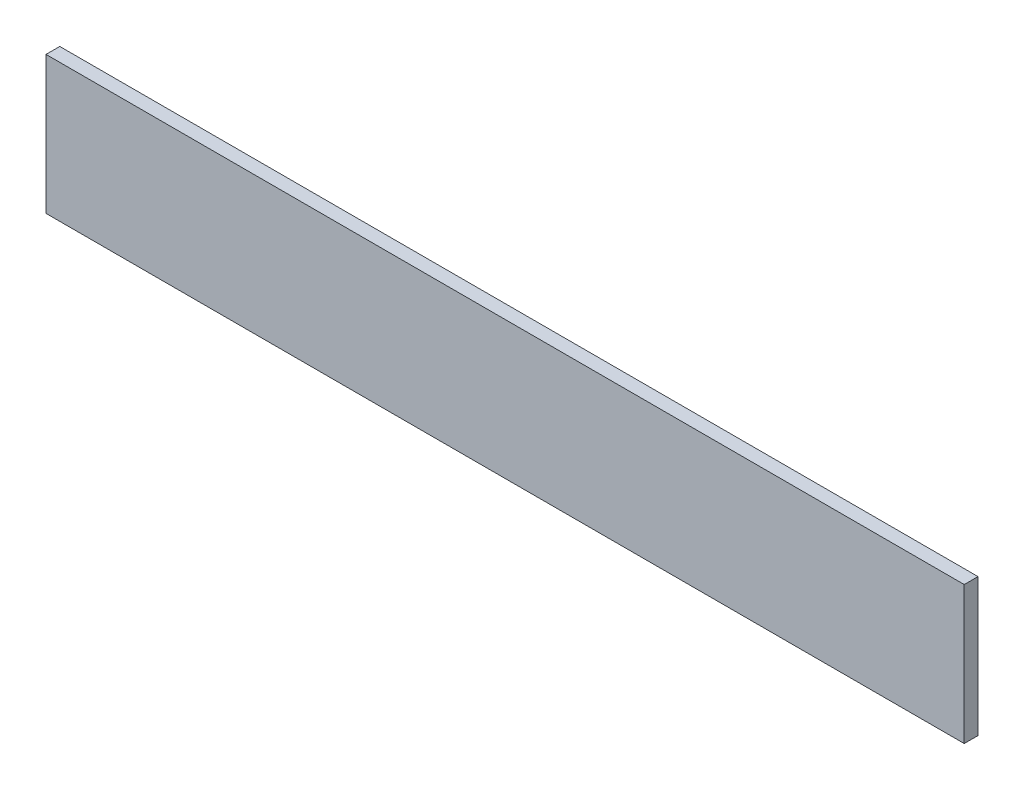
ISO-10303-21;
HEADER;
FILE_DESCRIPTION(('STEP AP214'),'2;1');
FILE_NAME('part.step','',(''),(''),'','','');
FILE_SCHEMA(('AUTOMOTIVE_DESIGN { 1 0 10303 214 1 1 1 1 }'));
ENDSEC;
DATA;
#1=APPLICATION_CONTEXT('core data for automotive mechanical design processes');
#2=APPLICATION_PROTOCOL_DEFINITION('international standard','automotive_design',2000,#1);
#3=PRODUCT_CONTEXT('',#1,'mechanical');
#4=PRODUCT('Part','Part','',(#3));
#5=PRODUCT_RELATED_PRODUCT_CATEGORY('part','',(#4));
#6=PRODUCT_DEFINITION_FORMATION('','',#4);
#7=PRODUCT_DEFINITION_CONTEXT('part definition',#1,'design');
#8=PRODUCT_DEFINITION('design','',#6,#7);
#9=PRODUCT_DEFINITION_SHAPE('','',#8);
#10=(LENGTH_UNIT() NAMED_UNIT(*) SI_UNIT(.MILLI.,.METRE.));
#11=(NAMED_UNIT(*) PLANE_ANGLE_UNIT() SI_UNIT($,.RADIAN.));
#12=(NAMED_UNIT(*) SI_UNIT($,.STERADIAN.) SOLID_ANGLE_UNIT());
#13=UNCERTAINTY_MEASURE_WITH_UNIT(LENGTH_MEASURE(1.E-05),#10,'distance_accuracy_value','');
#14=(GEOMETRIC_REPRESENTATION_CONTEXT(3) GLOBAL_UNCERTAINTY_ASSIGNED_CONTEXT((#13)) GLOBAL_UNIT_ASSIGNED_CONTEXT((#10,
#11,#12)) REPRESENTATION_CONTEXT('',''));
#15=CARTESIAN_POINT('',(0.,0.,0.));
#16=DIRECTION('',(0.,0.,1.));
#17=DIRECTION('',(1.,0.,0.));
#18=AXIS2_PLACEMENT_3D('',#15,#16,#17);
#19=CARTESIAN_POINT('',(0.,0.,0.6));
#20=DIRECTION('',(1.,0.,0.));
#21=DIRECTION('',(0.,0.,-1.));
#22=AXIS2_PLACEMENT_3D('',#19,#20,#21);
#23=PLANE('',#22);
#24=DIRECTION('',(0.,-1.,0.));
#25=VECTOR('',#24,1.);
#26=CARTESIAN_POINT('',(0.,0.,-0.6));
#27=LINE('',#26,#25);
#28=CARTESIAN_POINT('',(0.,12.,-0.6));
#29=VERTEX_POINT('',#28);
#30=CARTESIAN_POINT('',(0.,0.,-0.6));
#31=VERTEX_POINT('',#30);
#32=EDGE_CURVE('E81',#29,#31,#27,.T.);
#33=ORIENTED_EDGE('',*,*,#32,.T.);
#34=DIRECTION('',(0.,0.,-1.));
#35=VECTOR('',#34,1.);
#36=CARTESIAN_POINT('',(0.,0.,0.6));
#37=LINE('',#36,#35);
#38=CARTESIAN_POINT('',(0.,0.,0.6));
#39=VERTEX_POINT('',#38);
#40=EDGE_CURVE('E11',#39,#31,#37,.T.);
#41=ORIENTED_EDGE('',*,*,#40,.F.);
#42=DIRECTION('',(0.,-1.,0.));
#43=VECTOR('',#42,1.);
#44=CARTESIAN_POINT('',(0.,0.,0.6));
#45=LINE('',#44,#43);
#46=CARTESIAN_POINT('',(0.,12.,0.6));
#47=VERTEX_POINT('',#46);
#48=EDGE_CURVE('E99',#47,#39,#45,.T.);
#49=ORIENTED_EDGE('',*,*,#48,.F.);
#50=DIRECTION('',(0.,0.,-1.));
#51=VECTOR('',#50,1.);
#52=CARTESIAN_POINT('',(0.,12.,0.6));
#53=LINE('',#52,#51);
#54=EDGE_CURVE('E93',#47,#29,#53,.T.);
#55=ORIENTED_EDGE('',*,*,#54,.T.);
#56=EDGE_LOOP('',(#33,#41,#49,#55));
#57=FACE_BOUND('',#56,.T.);
#58=ADVANCED_FACE('F37',(#57),#23,.F.);
#59=CARTESIAN_POINT('',(0.,0.,0.6));
#60=DIRECTION('',(0.,1.,0.));
#61=DIRECTION('',(0.,0.,1.));
#62=AXIS2_PLACEMENT_3D('',#59,#60,#61);
#63=PLANE('',#62);
#64=DIRECTION('',(1.,0.,0.));
#65=VECTOR('',#64,1.);
#66=CARTESIAN_POINT('',(0.,0.,-0.6));
#67=LINE('',#66,#65);
#68=CARTESIAN_POINT('',(80.,0.,-0.6));
#69=VERTEX_POINT('',#68);
#70=EDGE_CURVE('E77',#31,#69,#67,.T.);
#71=ORIENTED_EDGE('',*,*,#70,.T.);
#72=DIRECTION('',(0.,0.,-1.));
#73=VECTOR('',#72,1.);
#74=CARTESIAN_POINT('',(80.,0.,0.6));
#75=LINE('',#74,#73);
#76=CARTESIAN_POINT('',(80.,0.,0.6));
#77=VERTEX_POINT('',#76);
#78=EDGE_CURVE('E44',#77,#69,#75,.T.);
#79=ORIENTED_EDGE('',*,*,#78,.F.);
#80=DIRECTION('',(1.,0.,0.));
#81=VECTOR('',#80,1.);
#82=CARTESIAN_POINT('',(0.,0.,0.6));
#83=LINE('',#82,#81);
#84=EDGE_CURVE('E89',#39,#77,#83,.T.);
#85=ORIENTED_EDGE('',*,*,#84,.F.);
#86=ORIENTED_EDGE('',*,*,#40,.T.);
#87=EDGE_LOOP('',(#71,#79,#85,#86));
#88=FACE_BOUND('',#87,.T.);
#89=ADVANCED_FACE('F88',(#88),#63,.F.);
#90=CARTESIAN_POINT('',(80.,0.,0.6));
#91=DIRECTION('',(-1.,0.,0.));
#92=DIRECTION('',(0.,0.,1.));
#93=AXIS2_PLACEMENT_3D('',#90,#91,#92);
#94=PLANE('',#93);
#95=DIRECTION('',(0.,1.,0.));
#96=VECTOR('',#95,1.);
#97=CARTESIAN_POINT('',(80.,0.,-0.6));
#98=LINE('',#97,#96);
#99=CARTESIAN_POINT('',(80.,12.,-0.6));
#100=VERTEX_POINT('',#99);
#101=EDGE_CURVE('E82',#69,#100,#98,.T.);
#102=ORIENTED_EDGE('',*,*,#101,.T.);
#103=DIRECTION('',(0.,0.,-1.));
#104=VECTOR('',#103,1.);
#105=CARTESIAN_POINT('',(80.,12.,0.6));
#106=LINE('',#105,#104);
#107=CARTESIAN_POINT('',(80.,12.,0.6));
#108=VERTEX_POINT('',#107);
#109=EDGE_CURVE('E105',#108,#100,#106,.T.);
#110=ORIENTED_EDGE('',*,*,#109,.F.);
#111=DIRECTION('',(0.,1.,0.));
#112=VECTOR('',#111,1.);
#113=CARTESIAN_POINT('',(80.,0.,0.6));
#114=LINE('',#113,#112);
#115=EDGE_CURVE('E56',#77,#108,#114,.T.);
#116=ORIENTED_EDGE('',*,*,#115,.F.);
#117=ORIENTED_EDGE('',*,*,#78,.T.);
#118=EDGE_LOOP('',(#102,#110,#116,#117));
#119=FACE_BOUND('',#118,.T.);
#120=ADVANCED_FACE('F108',(#119),#94,.F.);
#121=CARTESIAN_POINT('',(0.,12.,0.6));
#122=DIRECTION('',(0.,-1.,0.));
#123=DIRECTION('',(0.,0.,-1.));
#124=AXIS2_PLACEMENT_3D('',#121,#122,#123);
#125=PLANE('',#124);
#126=DIRECTION('',(-1.,0.,0.));
#127=VECTOR('',#126,1.);
#128=CARTESIAN_POINT('',(0.,12.,-0.6));
#129=LINE('',#128,#127);
#130=EDGE_CURVE('E97',#100,#29,#129,.T.);
#131=ORIENTED_EDGE('',*,*,#130,.T.);
#132=ORIENTED_EDGE('',*,*,#54,.F.);
#133=DIRECTION('',(-1.,0.,0.));
#134=VECTOR('',#133,1.);
#135=CARTESIAN_POINT('',(0.,12.,0.6));
#136=LINE('',#135,#134);
#137=EDGE_CURVE('E51',#108,#47,#136,.T.);
#138=ORIENTED_EDGE('',*,*,#137,.F.);
#139=ORIENTED_EDGE('',*,*,#109,.T.);
#140=EDGE_LOOP('',(#131,#132,#138,#139));
#141=FACE_BOUND('',#140,.T.);
#142=ADVANCED_FACE('F110',(#141),#125,.F.);
#143=CARTESIAN_POINT('',(0.,12.,0.6));
#144=DIRECTION('',(0.,0.,-1.));
#145=DIRECTION('',(-1.,0.,0.));
#146=AXIS2_PLACEMENT_3D('',#143,#144,#145);
#147=PLANE('',#146);
#148=ORIENTED_EDGE('',*,*,#48,.T.);
#149=ORIENTED_EDGE('',*,*,#84,.T.);
#150=ORIENTED_EDGE('',*,*,#115,.T.);
#151=ORIENTED_EDGE('',*,*,#137,.T.);
#152=EDGE_LOOP('',(#148,#149,#150,#151));
#153=FACE_BOUND('',#152,.T.);
#154=ADVANCED_FACE('F111',(#153),#147,.F.);
#155=CARTESIAN_POINT('',(0.,12.,-0.6));
#156=DIRECTION('',(0.,0.,-1.));
#157=DIRECTION('',(-1.,0.,0.));
#158=AXIS2_PLACEMENT_3D('',#155,#156,#157);
#159=PLANE('',#158);
#160=ORIENTED_EDGE('',*,*,#32,.F.);
#161=ORIENTED_EDGE('',*,*,#130,.F.);
#162=ORIENTED_EDGE('',*,*,#101,.F.);
#163=ORIENTED_EDGE('',*,*,#70,.F.);
#164=EDGE_LOOP('',(#160,#161,#162,#163));
#165=FACE_BOUND('',#164,.T.);
#166=ADVANCED_FACE('F78',(#165),#159,.T.);
#167=CLOSED_SHELL('',(#58,#89,#120,#142,#154,#166));
#168=MANIFOLD_SOLID_BREP('B2',#167);
#169=ADVANCED_BREP_SHAPE_REPRESENTATION('',(#18,#168),#14);
#170=SHAPE_DEFINITION_REPRESENTATION(#9,#169);
ENDSEC;
END-ISO-10303-21;
